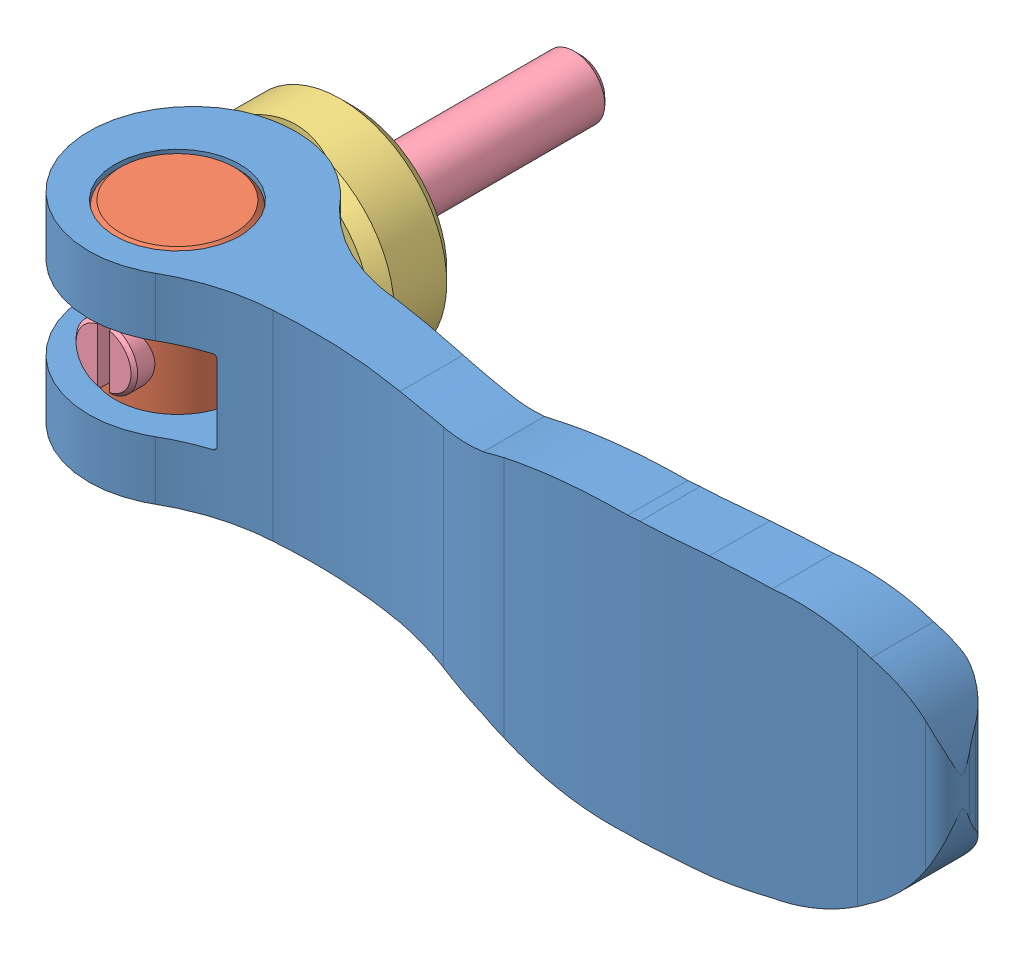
SolidWorks assembly KCL04X15-SUS.SLDASM, configuration Default (file format 15000). Lengths in mm.
Overall size (59.2 18.05 32.01).
4 component instances, 4 part files, 0 mates.
Components (placement in the parent):
- KCL4X15-SUS_01-1: KCL4X15-SUS_01.SLDPRT [ﾃﾞﾌｫﾙﾄ] at (0 0 11.4) x (1 0 0) z (0 -1 0) size (59.1 13.57 18.05)
- KCL4X15-SUS_02-1: KCL4X15-SUS_02.SLDPRT [ﾃﾞﾌｫﾙﾄ] at (0 0 11.4) x (0 1 0) z (1 0 0) size (13 8 8)
- KCL4X15-SUS_03-1: KCL4X15-SUS_03.SLDPRT [ﾃﾞﾌｫﾙﾄ] x (1 0 0) z (0 -1 0) size (13.8 5.38 13.8)
- KCL4X15-SUS_04-1: KCL4X15-SUS_04.SLDPRT [ﾃﾞﾌｫﾙﾄ] at (0 0 -14.8) x (0 1 0) z (1 0 0) size (4 31 4)
